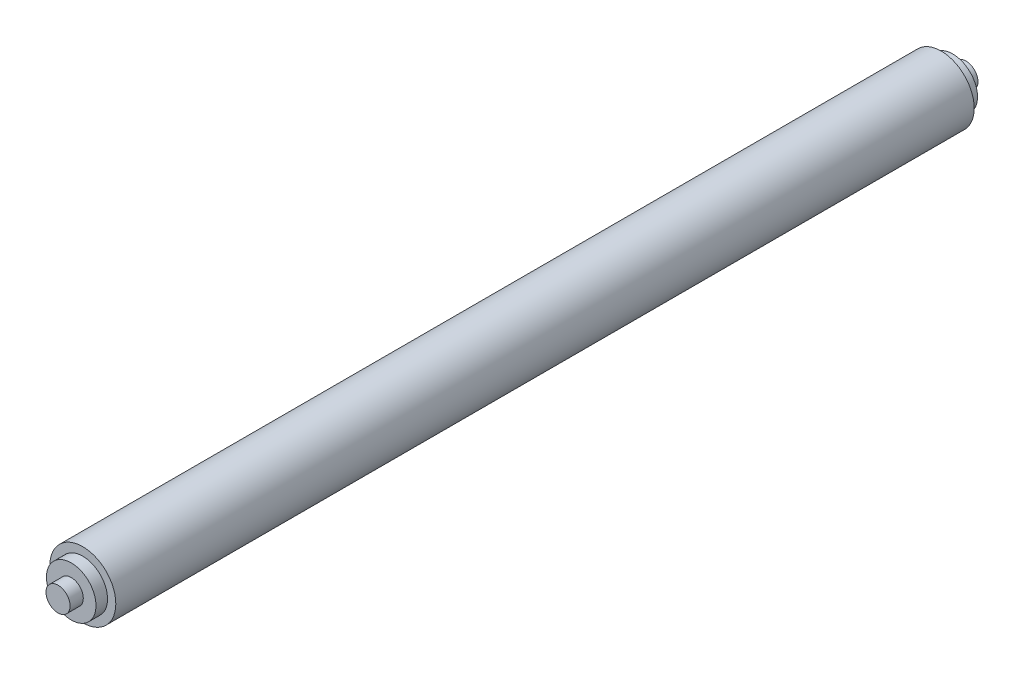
from build123d import *

# Parameters (mm, degrees)
SKETCH1_R           = 25.4
BASE_EXTRUDE_DEPTH  = 330.2
SKETCH2_R           = 19.05
BOSS_EXTRUDE1_DEPTH = 19.05
CUT_EXTRUDE1_START  = -10.16
SKETCH3_R           = 19.05
SKETCH3_R_2         = 9.271
CUT_EXTRUDE1_DEPTH  = 10.16


with BuildPart() as part:
    # Sketch1 → Base-Extrude (new, symmetric)
    with BuildSketch(Plane.XY):
        Circle(SKETCH1_R)
    extrude(amount=BASE_EXTRUDE_DEPTH, both=True)

    # Sketch2 → Boss-Extrude1 (add)
    with BuildSketch(Plane.XY.offset(330.2)):
        with Locations(Location((0, 0, 0), (0, 0, 180))):
            Circle(SKETCH2_R)
    boss_extrude1 = extrude(amount=BOSS_EXTRUDE1_DEPTH)

    # Sketch3 → Cut-Extrude1 (cut)
    with BuildSketch(Plane.XY.offset(349.25).offset(CUT_EXTRUDE1_START)):
        with Locations(Location((0, 0, 0), (0, 0, 180))):
            Circle(SKETCH3_R)
        Circle(SKETCH3_R_2, mode=Mode.SUBTRACT)
    cut_extrude1 = extrude(amount=CUT_EXTRUDE1_DEPTH, mode=Mode.SUBTRACT)

    # Mirror1: Boss-Extrude1, Cut-Extrude1 across plane
    add(boss_extrude1.mirror(Plane.XY))
    add(cut_extrude1.mirror(Plane.XY), mode=Mode.SUBTRACT)


solid = part.part
